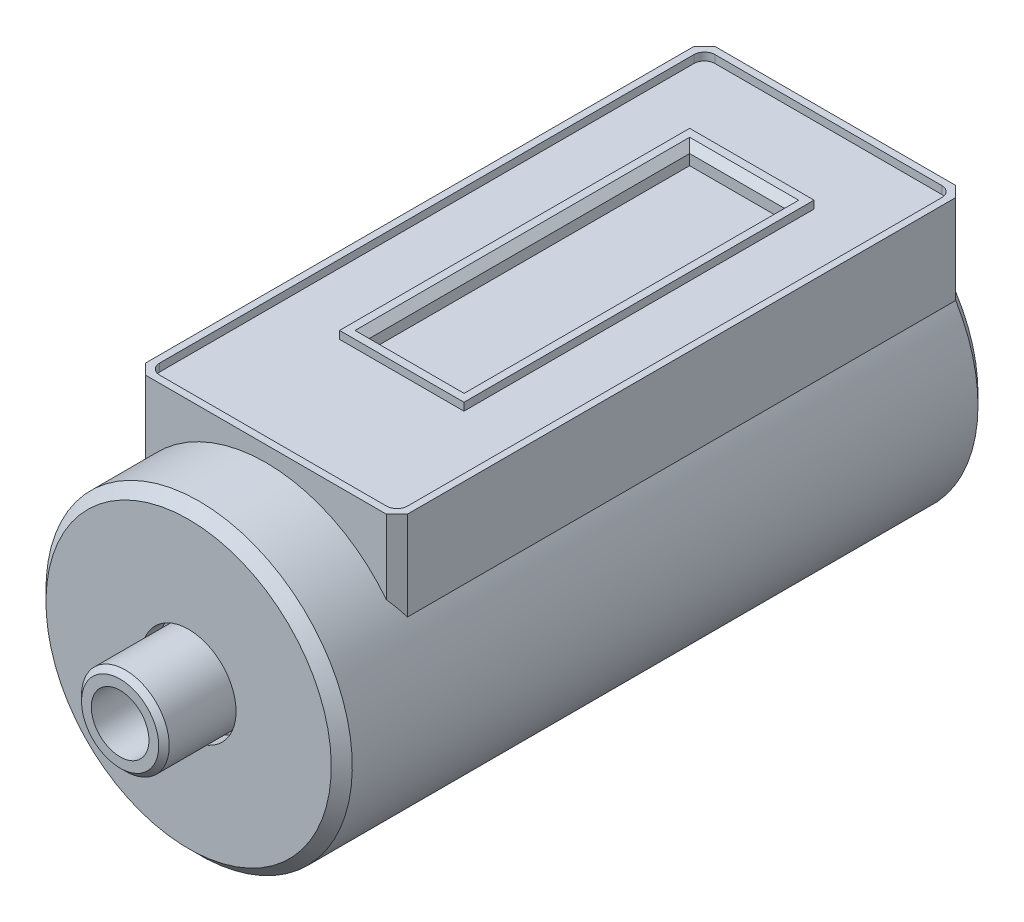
from build123d import *

# Parameters (mm, degrees)
EXTRUDE1_DEPTH     = 12.19
CHAMFER1_SIZE      = 0.76
SKETCH4_W          = 8.99
SKETCH4_H          = 25.3
CUT_EXTRUDE1_DEPTH = 0.56
SKETCH5_W          = 6.86
SKETCH5_H          = 23.16
CUT_EXTRUDE2_DEPTH = 1.27
CHAMFER2_SIZE      = 0.51
HOLE1_D            = 4.1656
HOLE1_DEPTH        = 6.35
HOLE1_TIP          = 1.251472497


with BuildPart() as part:
    # Sketch2 → Revolve1 (revolve)
    with BuildSketch(Plane(origin=(0, 0, 0), x_dir=(0, 0, -1), z_dir=(1, 0, 0))):
        Polygon((144.31, 0), (144.31, 2.79), (144.69, 3.17), (150.53, 3.17), (150.53, 3.43), (149.26, 3.43), (149.26, 10.31), (150.02, 11.07), (196, 11.07), (196, 0), align=None)
    revolve(axis=Axis((0, 0, -196), (0, 0, 1)))

    # Sketch3 → Extrude1 (add)
    with BuildSketch(Plane(origin=(0, 0, 0), x_dir=(1, 0, 0), z_dir=(0, 1, 0))):
        Polygon((-9.46, 196), (9.46, 196), (9.46, 155.61), (8.7, 154.85), (-8.7, 154.85), (-9.46, 155.61), align=None)
    extrude(amount=EXTRUDE1_DEPTH)

    # Chamfer1
    chamfer1_edges = [part.edges().sort_by_distance(p)[0] for p in [
        (0, -11.07, -196),
        (-9.46, 8.969599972, -196),
        (9.46, 8.969599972, -196),
    ]]
    chamfer(chamfer1_edges, length=CHAMFER1_SIZE)

    # Sketch4 → Cut-Extrude1 (cut)
    with BuildSketch(Plane(origin=(0, 12.19, 0), x_dir=(1, 0, 0), z_dir=(0, 1, 0))):
        with BuildLine():
            Line((-8.19, 195.49), (8.2, 195.49))
            ThreePointArc((8.2, 195.49), (8.737401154, 195.267401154), (8.96, 194.73))
            Line((8.96, 194.73), (8.96, 156.12))
            ThreePointArc((8.96, 156.12), (8.737401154, 155.582598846), (8.2, 155.36))
            Line((8.2, 155.36), (-8.19, 155.36))
            ThreePointArc((-8.19, 155.36), (-8.727401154, 155.582598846), (-8.95, 156.12))
            Line((-8.95, 156.12), (-8.95, 194.73))
            ThreePointArc((-8.95, 194.73), (-8.727401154, 195.267401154), (-8.19, 195.49))
        make_face()
        with Locations((0.005, 177.31)):
            Rectangle(SKETCH4_W, SKETCH4_H, mode=Mode.SUBTRACT)
    extrude(amount=-CUT_EXTRUDE1_DEPTH, mode=Mode.SUBTRACT)

    # Sketch5 → Cut-Extrude2 (cut)
    with BuildSketch(Plane(origin=(0, 12.19, 0), x_dir=(1, 0, 0), z_dir=(0, 1, 0))):
        with Locations((0.01, 177.31)):
            Rectangle(SKETCH5_W, SKETCH5_H)
    extrude(amount=-CUT_EXTRUDE2_DEPTH, mode=Mode.SUBTRACT)

    # Chamfer2
    chamfer2_edges = [part.edges().sort_by_distance(p)[0] for p in [
        (-3.42, 12.19, -177.31),
        (0.01, 12.19, -165.73),
        (3.44, 12.19, -177.31),
        (0.01, 12.19, -188.89),
    ]]
    chamfer(chamfer2_edges, length=CHAMFER2_SIZE)

    # Hole1
    with Locations(Plane.XY.offset(-144.31)):
        with Locations((0, 0)):
            Hole(HOLE1_D / 2, depth=HOLE1_DEPTH)
            with Locations((0, 0, -(HOLE1_DEPTH + HOLE1_TIP / 2))):  # 118° drill point
                Cone(0, HOLE1_D / 2, HOLE1_TIP, mode=Mode.SUBTRACT)


solid = part.part
